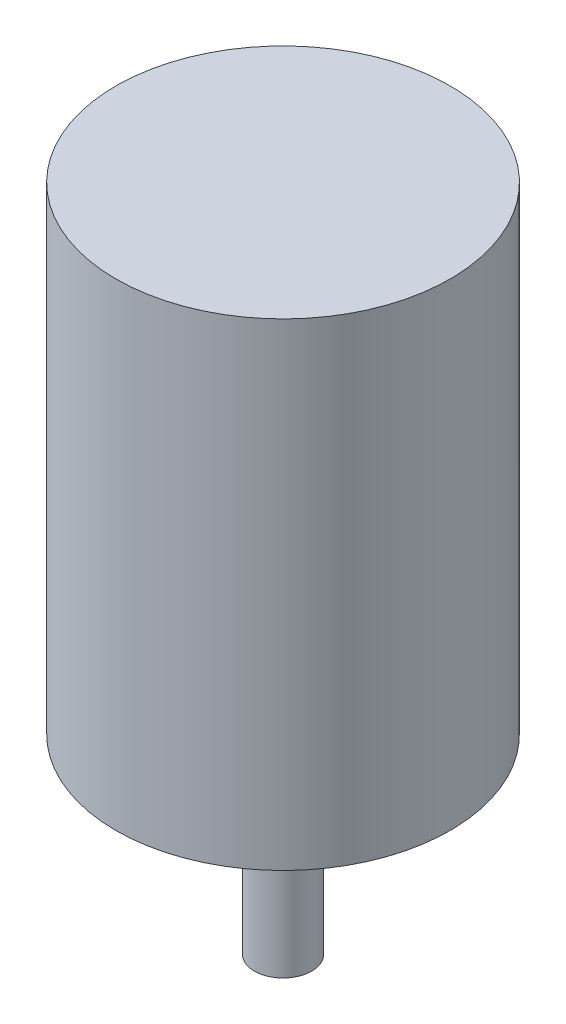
ISO-10303-21;
HEADER;
FILE_DESCRIPTION(('STEP AP214'),'2;1');
FILE_NAME('part.step','',(''),(''),'','','');
FILE_SCHEMA(('AUTOMOTIVE_DESIGN { 1 0 10303 214 1 1 1 1 }'));
ENDSEC;
DATA;
#1=APPLICATION_CONTEXT('core data for automotive mechanical design processes');
#2=APPLICATION_PROTOCOL_DEFINITION('international standard','automotive_design',2000,#1);
#3=PRODUCT_CONTEXT('',#1,'mechanical');
#4=PRODUCT('Part','Part','',(#3));
#5=PRODUCT_RELATED_PRODUCT_CATEGORY('part','',(#4));
#6=PRODUCT_DEFINITION_FORMATION('','',#4);
#7=PRODUCT_DEFINITION_CONTEXT('part definition',#1,'design');
#8=PRODUCT_DEFINITION('design','',#6,#7);
#9=PRODUCT_DEFINITION_SHAPE('','',#8);
#10=(LENGTH_UNIT() NAMED_UNIT(*) SI_UNIT(.MILLI.,.METRE.));
#11=(NAMED_UNIT(*) PLANE_ANGLE_UNIT() SI_UNIT($,.RADIAN.));
#12=(NAMED_UNIT(*) SI_UNIT($,.STERADIAN.) SOLID_ANGLE_UNIT());
#13=UNCERTAINTY_MEASURE_WITH_UNIT(LENGTH_MEASURE(1.E-05),#10,'distance_accuracy_value','');
#14=(GEOMETRIC_REPRESENTATION_CONTEXT(3) GLOBAL_UNCERTAINTY_ASSIGNED_CONTEXT((#13)) GLOBAL_UNIT_ASSIGNED_CONTEXT((#10,
#11,#12)) REPRESENTATION_CONTEXT('',''));
#15=CARTESIAN_POINT('',(0.,0.,0.));
#16=DIRECTION('',(0.,0.,1.));
#17=DIRECTION('',(1.,0.,0.));
#18=AXIS2_PLACEMENT_3D('',#15,#16,#17);
#19=CARTESIAN_POINT('',(0.,-250.,0.));
#20=DIRECTION('',(0.,1.,0.));
#21=DIRECTION('',(0.,0.,1.));
#22=AXIS2_PLACEMENT_3D('',#19,#20,#21);
#23=PLANE('',#22);
#24=CARTESIAN_POINT('',(0.,-250.,0.));
#25=DIRECTION('',(0.,1.,0.));
#26=DIRECTION('',(0.,0.,1.));
#27=AXIS2_PLACEMENT_3D('',#24,#25,#26);
#28=CIRCLE('',#27,87.5);
#29=CARTESIAN_POINT('',(0.,-250.,87.5));
#30=VERTEX_POINT('',#29);
#31=EDGE_CURVE('E37',#30,#30,#28,.T.);
#32=ORIENTED_EDGE('',*,*,#31,.F.);
#33=EDGE_LOOP('',(#32));
#34=FACE_BOUND('',#33,.T.);
#35=CARTESIAN_POINT('',(0.,-250.,0.));
#36=DIRECTION('',(0.,1.,0.));
#37=DIRECTION('',(0.,0.,1.));
#38=AXIS2_PLACEMENT_3D('',#35,#36,#37);
#39=CIRCLE('',#38,15.);
#40=CARTESIAN_POINT('',(0.,-250.,15.));
#41=VERTEX_POINT('',#40);
#42=EDGE_CURVE('E10',#41,#41,#39,.F.);
#43=ORIENTED_EDGE('',*,*,#42,.F.);
#44=EDGE_LOOP('',(#43));
#45=FACE_BOUND('',#44,.T.);
#46=ADVANCED_FACE('F30',(#34,#45),#23,.F.);
#47=CARTESIAN_POINT('',(0.,-250.,0.));
#48=DIRECTION('',(0.,1.,0.));
#49=DIRECTION('',(0.,0.,1.));
#50=AXIS2_PLACEMENT_3D('',#47,#48,#49);
#51=CYLINDRICAL_SURFACE('',#50,87.5);
#52=ORIENTED_EDGE('',*,*,#31,.T.);
#53=EDGE_LOOP('',(#52));
#54=FACE_BOUND('',#53,.T.);
#55=CARTESIAN_POINT('',(0.,0.,0.));
#56=DIRECTION('',(0.,1.,0.));
#57=DIRECTION('',(0.,0.,1.));
#58=AXIS2_PLACEMENT_3D('',#55,#56,#57);
#59=CIRCLE('',#58,87.5);
#60=CARTESIAN_POINT('',(0.,0.,87.5));
#61=VERTEX_POINT('',#60);
#62=EDGE_CURVE('E41',#61,#61,#59,.T.);
#63=ORIENTED_EDGE('',*,*,#62,.F.);
#64=EDGE_LOOP('',(#63));
#65=FACE_BOUND('',#64,.T.);
#66=ADVANCED_FACE('F32',(#54,#65),#51,.T.);
#67=CARTESIAN_POINT('',(0.,0.,0.));
#68=DIRECTION('',(0.,1.,0.));
#69=DIRECTION('',(0.,0.,1.));
#70=AXIS2_PLACEMENT_3D('',#67,#68,#69);
#71=PLANE('',#70);
#72=ORIENTED_EDGE('',*,*,#62,.T.);
#73=EDGE_LOOP('',(#72));
#74=FACE_BOUND('',#73,.T.);
#75=ADVANCED_FACE('F55',(#74),#71,.T.);
#76=CARTESIAN_POINT('',(0.,-350.,0.));
#77=DIRECTION('',(0.,1.,0.));
#78=DIRECTION('',(0.,0.,1.));
#79=AXIS2_PLACEMENT_3D('',#76,#77,#78);
#80=CYLINDRICAL_SURFACE('',#79,15.);
#81=CARTESIAN_POINT('',(0.,-350.,0.));
#82=DIRECTION('',(0.,-1.,0.));
#83=DIRECTION('',(0.,0.,-1.));
#84=AXIS2_PLACEMENT_3D('',#81,#82,#83);
#85=CIRCLE('',#84,15.);
#86=CARTESIAN_POINT('',(0.,-350.,-15.));
#87=VERTEX_POINT('',#86);
#88=EDGE_CURVE('E46',#87,#87,#85,.T.);
#89=ORIENTED_EDGE('',*,*,#88,.F.);
#90=EDGE_LOOP('',(#89));
#91=FACE_BOUND('',#90,.T.);
#92=ORIENTED_EDGE('',*,*,#42,.T.);
#93=EDGE_LOOP('',(#92));
#94=FACE_BOUND('',#93,.T.);
#95=ADVANCED_FACE('F53',(#91,#94),#80,.T.);
#96=CARTESIAN_POINT('',(0.,-350.,0.));
#97=DIRECTION('',(0.,-1.,0.));
#98=DIRECTION('',(0.,0.,-1.));
#99=AXIS2_PLACEMENT_3D('',#96,#97,#98);
#100=PLANE('',#99);
#101=ORIENTED_EDGE('',*,*,#88,.T.);
#102=EDGE_LOOP('',(#101));
#103=FACE_BOUND('',#102,.T.);
#104=ADVANCED_FACE('F51',(#103),#100,.T.);
#105=CLOSED_SHELL('',(#46,#66,#75,#95,#104));
#106=MANIFOLD_SOLID_BREP('B2',#105);
#107=ADVANCED_BREP_SHAPE_REPRESENTATION('',(#18,#106),#14);
#108=SHAPE_DEFINITION_REPRESENTATION(#9,#107);
ENDSEC;
END-ISO-10303-21;
